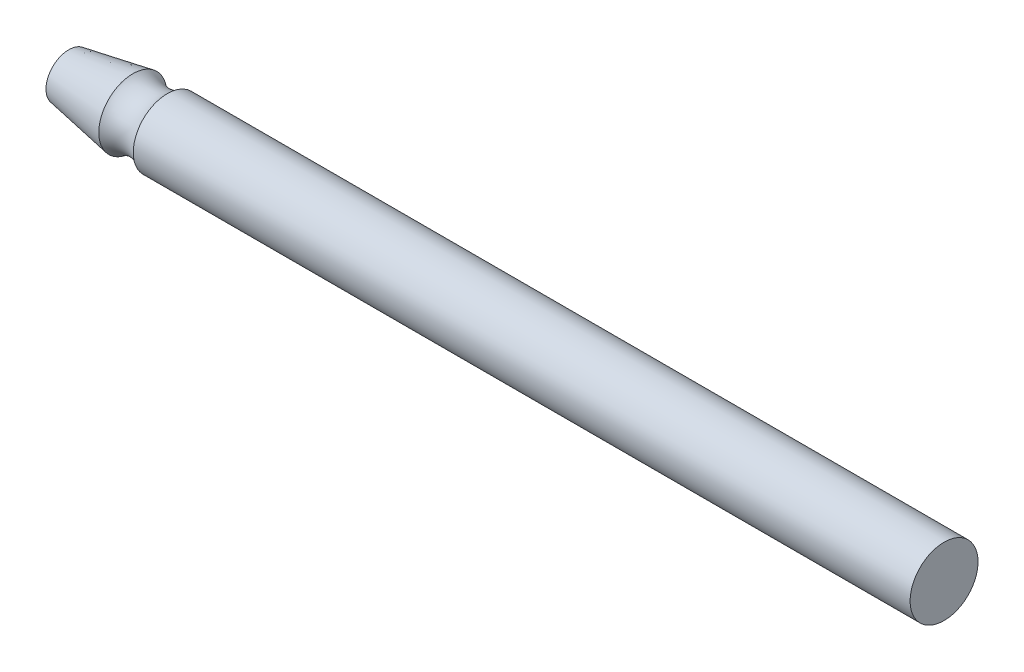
ISO-10303-21;
HEADER;
FILE_DESCRIPTION(('STEP AP214'),'2;1');
FILE_NAME('part.step','',(''),(''),'','','');
FILE_SCHEMA(('AUTOMOTIVE_DESIGN { 1 0 10303 214 1 1 1 1 }'));
ENDSEC;
DATA;
#1=APPLICATION_CONTEXT('core data for automotive mechanical design processes');
#2=APPLICATION_PROTOCOL_DEFINITION('international standard','automotive_design',2000,#1);
#3=PRODUCT_CONTEXT('',#1,'mechanical');
#4=PRODUCT('Part','Part','',(#3));
#5=PRODUCT_RELATED_PRODUCT_CATEGORY('part','',(#4));
#6=PRODUCT_DEFINITION_FORMATION('','',#4);
#7=PRODUCT_DEFINITION_CONTEXT('part definition',#1,'design');
#8=PRODUCT_DEFINITION('design','',#6,#7);
#9=PRODUCT_DEFINITION_SHAPE('','',#8);
#10=(LENGTH_UNIT() NAMED_UNIT(*) SI_UNIT(.MILLI.,.METRE.));
#11=(NAMED_UNIT(*) PLANE_ANGLE_UNIT() SI_UNIT($,.RADIAN.));
#12=(NAMED_UNIT(*) SI_UNIT($,.STERADIAN.) SOLID_ANGLE_UNIT());
#13=UNCERTAINTY_MEASURE_WITH_UNIT(LENGTH_MEASURE(1.E-05),#10,'distance_accuracy_value','');
#14=(GEOMETRIC_REPRESENTATION_CONTEXT(3) GLOBAL_UNCERTAINTY_ASSIGNED_CONTEXT((#13)) GLOBAL_UNIT_ASSIGNED_CONTEXT((#10,
#11,#12)) REPRESENTATION_CONTEXT('',''));
#15=CARTESIAN_POINT('',(0.,0.,0.));
#16=DIRECTION('',(0.,0.,1.));
#17=DIRECTION('',(1.,0.,0.));
#18=AXIS2_PLACEMENT_3D('',#15,#16,#17);
#19=CARTESIAN_POINT('',(-45.075,0.,0.));
#20=DIRECTION('',(1.,0.,0.));
#21=DIRECTION('',(0.,0.,-1.));
#22=AXIS2_PLACEMENT_3D('',#19,#20,#21);
#23=PLANE('',#22);
#24=CARTESIAN_POINT('',(-45.075,0.,0.));
#25=DIRECTION('',(-1.,0.,0.));
#26=DIRECTION('',(0.,0.,1.));
#27=AXIS2_PLACEMENT_3D('',#24,#25,#26);
#28=CIRCLE('',#27,1.525);
#29=CARTESIAN_POINT('',(-45.075,0.,1.525));
#30=VERTEX_POINT('',#29);
#31=EDGE_CURVE('E69',#30,#30,#28,.T.);
#32=ORIENTED_EDGE('',*,*,#31,.F.);
#33=EDGE_LOOP('',(#32));
#34=FACE_BOUND('',#33,.T.);
#35=CARTESIAN_POINT('',(-45.075,0.,0.));
#36=DIRECTION('',(-1.,0.,0.));
#37=DIRECTION('',(0.,0.,1.));
#38=AXIS2_PLACEMENT_3D('',#35,#36,#37);
#39=CIRCLE('',#38,2.33624192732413);
#40=CARTESIAN_POINT('',(-45.075,0.,2.33624192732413));
#41=VERTEX_POINT('',#40);
#42=EDGE_CURVE('E11',#41,#41,#39,.T.);
#43=ORIENTED_EDGE('',*,*,#42,.T.);
#44=EDGE_LOOP('',(#43));
#45=FACE_BOUND('',#44,.T.);
#46=ADVANCED_FACE('F43',(#34,#45),#23,.F.);
#47=CARTESIAN_POINT('',(-38.475,0.,0.));
#48=DIRECTION('',(1.,0.,0.));
#49=DIRECTION('',(0.,0.,-1.));
#50=AXIS2_PLACEMENT_3D('',#47,#48,#49);
#51=CONICAL_SURFACE('',#50,3.50000000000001,0.174532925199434);
#52=ORIENTED_EDGE('',*,*,#42,.F.);
#53=EDGE_LOOP('',(#52));
#54=FACE_BOUND('',#53,.T.);
#55=CARTESIAN_POINT('',(-38.475,0.,0.));
#56=DIRECTION('',(-1.,0.,0.));
#57=DIRECTION('',(0.,0.,1.));
#58=AXIS2_PLACEMENT_3D('',#55,#56,#57);
#59=CIRCLE('',#58,3.50000000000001);
#60=CARTESIAN_POINT('',(-38.475,0.,3.50000000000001));
#61=VERTEX_POINT('',#60);
#62=EDGE_CURVE('E49',#61,#61,#59,.T.);
#63=ORIENTED_EDGE('',*,*,#62,.T.);
#64=EDGE_LOOP('',(#63));
#65=FACE_BOUND('',#64,.T.);
#66=ADVANCED_FACE('F77',(#54,#65),#51,.T.);
#67=CARTESIAN_POINT('',(-36.7,0.,0.));
#68=DIRECTION('',(-1.,0.,0.));
#69=DIRECTION('',(0.,0.,1.));
#70=AXIS2_PLACEMENT_3D('',#67,#68,#69);
#71=TOROIDAL_SURFACE('',#70,5.66549647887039,2.8);
#72=ORIENTED_EDGE('',*,*,#62,.F.);
#73=EDGE_LOOP('',(#72));
#74=FACE_BOUND('',#73,.T.);
#75=CARTESIAN_POINT('',(-34.925,0.,0.));
#76=DIRECTION('',(-1.,0.,0.));
#77=DIRECTION('',(0.,0.,1.));
#78=AXIS2_PLACEMENT_3D('',#75,#76,#77);
#79=CIRCLE('',#78,3.50000000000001);
#80=CARTESIAN_POINT('',(-34.925,0.,3.50000000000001));
#81=VERTEX_POINT('',#80);
#82=EDGE_CURVE('E66',#81,#81,#79,.T.);
#83=ORIENTED_EDGE('',*,*,#82,.T.);
#84=EDGE_LOOP('',(#83));
#85=FACE_BOUND('',#84,.T.);
#86=ADVANCED_FACE('F79',(#74,#85),#71,.F.);
#87=CARTESIAN_POINT('',(-45.075,0.,0.));
#88=DIRECTION('',(-1.,0.,0.));
#89=DIRECTION('',(0.,0.,1.));
#90=AXIS2_PLACEMENT_3D('',#87,#88,#89);
#91=CYLINDRICAL_SURFACE('',#90,3.5);
#92=ORIENTED_EDGE('',*,*,#82,.F.);
#93=EDGE_LOOP('',(#92));
#94=FACE_BOUND('',#93,.T.);
#95=CARTESIAN_POINT('',(45.075,0.,0.));
#96=DIRECTION('',(-1.,0.,0.));
#97=DIRECTION('',(0.,0.,1.));
#98=AXIS2_PLACEMENT_3D('',#95,#96,#97);
#99=CIRCLE('',#98,3.49999999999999);
#100=CARTESIAN_POINT('',(45.075,0.,3.49999999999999));
#101=VERTEX_POINT('',#100);
#102=EDGE_CURVE('E62',#101,#101,#99,.T.);
#103=ORIENTED_EDGE('',*,*,#102,.T.);
#104=EDGE_LOOP('',(#103));
#105=FACE_BOUND('',#104,.T.);
#106=ADVANCED_FACE('F82',(#94,#105),#91,.T.);
#107=CARTESIAN_POINT('',(45.075,3.49999999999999,0.));
#108=DIRECTION('',(-1.,0.,0.));
#109=DIRECTION('',(0.,0.,1.));
#110=AXIS2_PLACEMENT_3D('',#107,#108,#109);
#111=PLANE('',#110);
#112=ORIENTED_EDGE('',*,*,#102,.F.);
#113=EDGE_LOOP('',(#112));
#114=FACE_BOUND('',#113,.T.);
#115=ADVANCED_FACE('F56',(#114),#111,.F.);
#116=CARTESIAN_POINT('',(-27.075,0.,0.));
#117=DIRECTION('',(-1.,0.,0.));
#118=DIRECTION('',(0.,0.,1.));
#119=AXIS2_PLACEMENT_3D('',#116,#117,#118);
#120=CONICAL_SURFACE('',#119,1.25,1.02974425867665);
#121=CARTESIAN_POINT('',(-26.3239242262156,0.,0.));
#122=VERTEX_POINT('',#121);
#123=VERTEX_LOOP('',#122);
#124=FACE_BOUND('',#123,.T.);
#125=CARTESIAN_POINT('',(-27.075,0.,0.));
#126=DIRECTION('',(-1.,0.,0.));
#127=DIRECTION('',(0.,0.,1.));
#128=AXIS2_PLACEMENT_3D('',#125,#126,#127);
#129=CIRCLE('',#128,1.25);
#130=CARTESIAN_POINT('',(-27.075,0.,1.25));
#131=VERTEX_POINT('',#130);
#132=EDGE_CURVE('E60',#131,#131,#129,.T.);
#133=ORIENTED_EDGE('',*,*,#132,.T.);
#134=EDGE_LOOP('',(#133));
#135=FACE_BOUND('',#134,.T.);
#136=ADVANCED_FACE('F52',(#124,#135),#120,.F.);
#137=CARTESIAN_POINT('',(-45.075,0.,0.));
#138=DIRECTION('',(-1.,0.,0.));
#139=DIRECTION('',(0.,0.,1.));
#140=AXIS2_PLACEMENT_3D('',#137,#138,#139);
#141=CYLINDRICAL_SURFACE('',#140,1.25);
#142=ORIENTED_EDGE('',*,*,#132,.F.);
#143=EDGE_LOOP('',(#142));
#144=FACE_BOUND('',#143,.T.);
#145=CARTESIAN_POINT('',(-44.7586486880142,0.,0.));
#146=DIRECTION('',(-1.,0.,0.));
#147=DIRECTION('',(0.,0.,1.));
#148=AXIS2_PLACEMENT_3D('',#145,#146,#147);
#149=CIRCLE('',#148,1.25);
#150=CARTESIAN_POINT('',(-44.7586486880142,0.,1.25));
#151=VERTEX_POINT('',#150);
#152=EDGE_CURVE('E63',#151,#151,#149,.T.);
#153=ORIENTED_EDGE('',*,*,#152,.T.);
#154=EDGE_LOOP('',(#153));
#155=FACE_BOUND('',#154,.T.);
#156=ADVANCED_FACE('F55',(#144,#155),#141,.F.);
#157=CARTESIAN_POINT('',(-45.075,0.,0.));
#158=DIRECTION('',(-1.,0.,0.));
#159=DIRECTION('',(0.,0.,1.));
#160=AXIS2_PLACEMENT_3D('',#157,#158,#159);
#161=CONICAL_SURFACE('',#160,1.525,0.715584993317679);
#162=ORIENTED_EDGE('',*,*,#152,.F.);
#163=EDGE_LOOP('',(#162));
#164=FACE_BOUND('',#163,.T.);
#165=ORIENTED_EDGE('',*,*,#31,.T.);
#166=EDGE_LOOP('',(#165));
#167=FACE_BOUND('',#166,.T.);
#168=ADVANCED_FACE('F106',(#164,#167),#161,.F.);
#169=CLOSED_SHELL('',(#46,#66,#86,#106,#115,#136,#156,#168));
#170=MANIFOLD_SOLID_BREP('B2',#169);
#171=ADVANCED_BREP_SHAPE_REPRESENTATION('',(#18,#170),#14);
#172=SHAPE_DEFINITION_REPRESENTATION(#9,#171);
ENDSEC;
END-ISO-10303-21;
